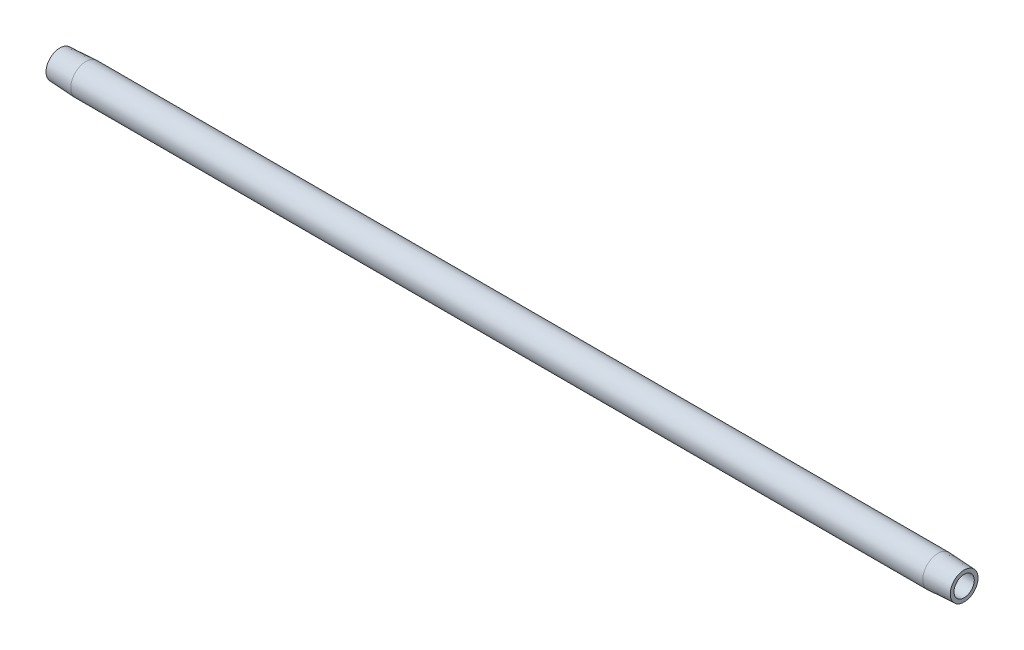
from build123d import *


with BuildPart() as part:
    # Sketch2 → Revolve1 (revolve)
    with BuildSketch(Plane.XY, mode=Mode.PRIVATE) as revolve1_sk:
        Polygon((8.810039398, 5.1435), (0, 4.6817854), (0, 3.4163), (304.8, 3.4163), (304.8, 4.6817854), (295.989960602, 5.1435), align=None)
    revolve(revolve1_sk.sketch.rotate(Axis((0.476141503, 0, 0), (1, 0, 0)), 90), axis=Axis((0.476141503, 0, 0), (1, 0, 0)))


solid = part.part
